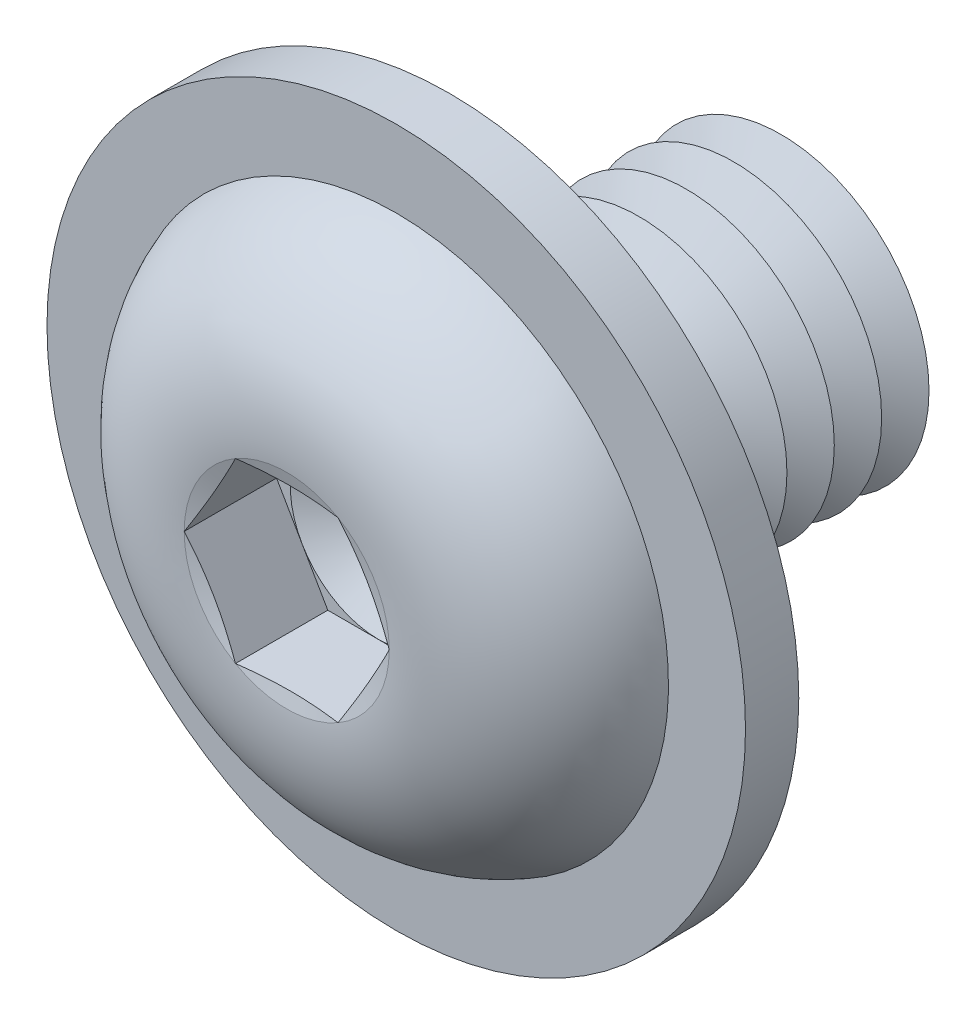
from build123d import *

# Parameters (mm, degrees)
FILLET1_R           = 0.4
LPATTERN1_COUNT     = 7
LPATTERN1_PITCH     = 0.8
CUT_EXTRUDE1_DEPTH  = 1.56
SKETCH5_R           = 5.9
SKETCH5_R_2         = 2.9
BOSS_EXTRUDE1_DEPTH = 0.9


with BuildPart() as part:
    # Sketch1 → Revolve1 (revolve)
    with BuildSketch(Plane(origin=(0, 0, 0), x_dir=(0, 0, -1), z_dir=(1, 0, 0)), mode=Mode.PRIVATE) as revolve1_sk:
        with BuildLine():
            Line((0, 2.5), (0, 4.75))
            ThreePointArc((0, 4.75), (-2.041477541, 3.848329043), (-2.75, 1.73205))
            Line((-2.75, 1.73205), (-2.517949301, 0.866025))
            Line((-2.517949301, 0.866025), (-2.75, 0.866025))
            Line((-2.75, 0.866025), (-2.75, 0))
            Line((-2.75, 0), (6, 0))
            Line((6, 0), (6, 2.5))
            Line((6, 2.5), (0, 2.5))
        make_face()
    revolve(revolve1_sk.sketch.rotate(Axis((0, 0, -6), (0, 0, 1)), 90), axis=Axis((0, 0, -6), (0, 0, 1)))

    # Fillet1
    fillet1_edges = [part.edges().sort_by_distance(p)[0] for p in [
        (2.5, 0, 0),
    ]]
    fillet(fillet1_edges, radius=FILLET1_R)

    # Sketch2 → Cut-Revolve1 (revolve, cut)
    with BuildSketch(Plane(origin=(0, 0, 0), x_dir=(0, 0, -1), z_dir=(1, 0, 0)), mode=Mode.PRIVATE) as cut_revolve1_sk:
        Polygon((5.6, 2.5), (6.4, 2.5), (6, 1.807179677), align=None)
    cut_revolve1 = revolve(cut_revolve1_sk.sketch.rotate(Axis((0, 0, -6), (0, 0, -1)), 270), axis=Axis((0, 0, -6), (0, 0, -1)), mode=Mode.SUBTRACT)

    # LPattern1: Cut-Revolve1 ×7
    with Locations(*[(0, 0, i * LPATTERN1_PITCH) for i in range(1, LPATTERN1_COUNT)]):
        add(cut_revolve1, mode=Mode.SUBTRACT)

    # Sketch3 → Cut-Extrude1 (cut)
    with BuildSketch(Plane.XY.offset(2.75)):
        Polygon((0.866025, 1.499999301), (-0.866025, 1.499999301), (-1.73205, 0), (-0.866025, -1.499999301), (0.866025, -1.499999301), (1.73205, 0), align=None)
    extrude(amount=-CUT_EXTRUDE1_DEPTH, mode=Mode.SUBTRACT)

    # Cut-Extrude2 cone 1 section (on through the dimple's axis) → Cut-Extrude2 (revolve, cut)
    with BuildSketch(Plane(origin=(0, 0, 1.19), x_dir=(0, -1, 0), z_dir=(1, 0, 0))):
        Polygon((0, 0), (1.499999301, 0), (0, 0.866025), align=None)
    revolve(axis=Axis((0, 0, 1.19), (0, 0, -1)), mode=Mode.SUBTRACT)

    # Sketch5 → Boss-Extrude1 (add)
    with BuildSketch(Plane(origin=(0, 0, 0), x_dir=(-1, 0, 0), z_dir=(0, 0, -1))):
        with Locations(Location((0, 0, 0), (0, 0, 90))):
            Circle(SKETCH5_R)
        Circle(SKETCH5_R_2, mode=Mode.SUBTRACT)
    extrude(amount=-BOSS_EXTRUDE1_DEPTH)


solid = part.part
